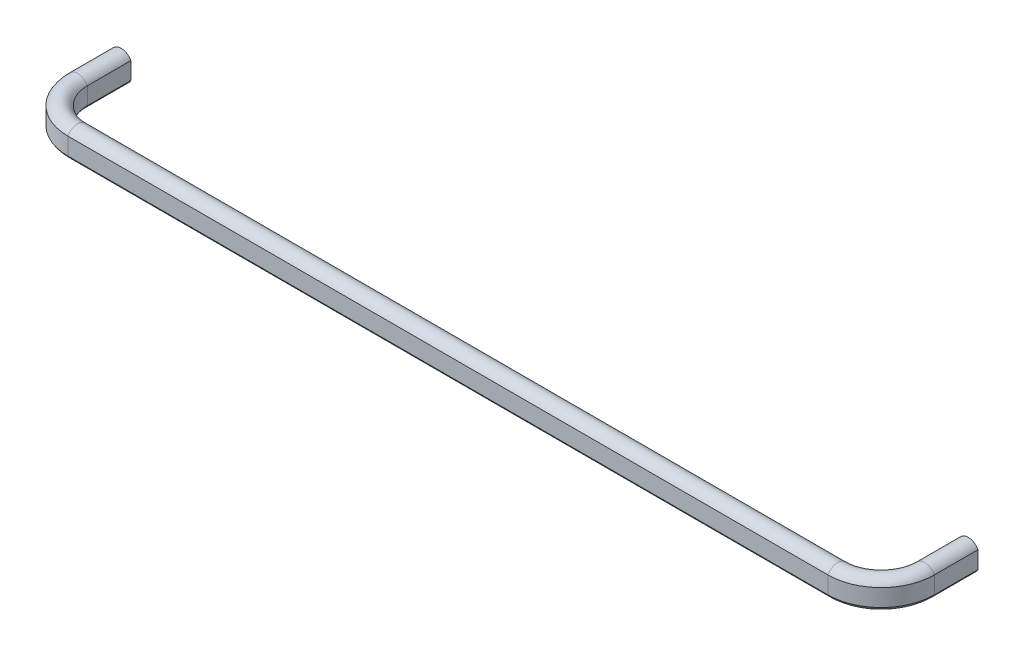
ISO-10303-21;
HEADER;
FILE_DESCRIPTION(('STEP AP214'),'2;1');
FILE_NAME('part.step','',(''),(''),'','','');
FILE_SCHEMA(('AUTOMOTIVE_DESIGN { 1 0 10303 214 1 1 1 1 }'));
ENDSEC;
DATA;
#1=APPLICATION_CONTEXT('core data for automotive mechanical design processes');
#2=APPLICATION_PROTOCOL_DEFINITION('international standard','automotive_design',2000,#1);
#3=PRODUCT_CONTEXT('',#1,'mechanical');
#4=PRODUCT('Part','Part','',(#3));
#5=PRODUCT_RELATED_PRODUCT_CATEGORY('part','',(#4));
#6=PRODUCT_DEFINITION_FORMATION('','',#4);
#7=PRODUCT_DEFINITION_CONTEXT('part definition',#1,'design');
#8=PRODUCT_DEFINITION('design','',#6,#7);
#9=PRODUCT_DEFINITION_SHAPE('','',#8);
#10=(LENGTH_UNIT() NAMED_UNIT(*) SI_UNIT(.MILLI.,.METRE.));
#11=(NAMED_UNIT(*) PLANE_ANGLE_UNIT() SI_UNIT($,.RADIAN.));
#12=(NAMED_UNIT(*) SI_UNIT($,.STERADIAN.) SOLID_ANGLE_UNIT());
#13=UNCERTAINTY_MEASURE_WITH_UNIT(LENGTH_MEASURE(1.E-05),#10,'distance_accuracy_value','');
#14=(GEOMETRIC_REPRESENTATION_CONTEXT(3) GLOBAL_UNCERTAINTY_ASSIGNED_CONTEXT((#13)) GLOBAL_UNIT_ASSIGNED_CONTEXT((#10,
#11,#12)) REPRESENTATION_CONTEXT('',''));
#15=CARTESIAN_POINT('',(0.,0.,0.));
#16=DIRECTION('',(0.,0.,1.));
#17=DIRECTION('',(1.,0.,0.));
#18=AXIS2_PLACEMENT_3D('',#15,#16,#17);
#19=CARTESIAN_POINT('',(2.00072019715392E-07,-1.4999967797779,0.));
#20=DIRECTION('',(0.,0.,1.));
#21=DIRECTION('',(0.,-1.,0.));
#22=AXIS2_PLACEMENT_3D('',#19,#20,#21);
#23=PLANE('',#22);
#24=CARTESIAN_POINT('',(0.,0.,0.));
#25=DIRECTION('',(0.,0.,1.));
#26=DIRECTION('',(1.,0.,0.));
#27=AXIS2_PLACEMENT_3D('',#24,#25,#26);
#28=CIRCLE('',#27,2.94999999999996);
#29=CARTESIAN_POINT('',(2.94999999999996,0.,0.));
#30=VERTEX_POINT('',#29);
#31=EDGE_CURVE('E9',#30,#30,#28,.T.);
#32=ORIENTED_EDGE('',*,*,#31,.T.);
#33=EDGE_LOOP('',(#32));
#34=FACE_BOUND('',#33,.T.);
#35=CARTESIAN_POINT('',(2.00072019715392E-07,-1.4999967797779,0.));
#36=DIRECTION('',(0.,0.,1.));
#37=DIRECTION('',(0.,-1.,0.));
#38=AXIS2_PLACEMENT_3D('',#35,#36,#37);
#39=CIRCLE('',#38,4.50000272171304);
#40=CARTESIAN_POINT('',(-4.,-3.56155079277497,0.));
#41=VERTEX_POINT('',#40);
#42=CARTESIAN_POINT('',(4.00000119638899,-3.56154924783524,0.));
#43=VERTEX_POINT('',#42);
#44=EDGE_CURVE('E209',#41,#43,#39,.T.);
#45=ORIENTED_EDGE('',*,*,#44,.F.);
#46=DIRECTION('',(0.,1.,0.));
#47=VECTOR('',#46,1.);
#48=CARTESIAN_POINT('',(-4.,-3.56155079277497,0.));
#49=LINE('',#48,#47);
#50=CARTESIAN_POINT('',(-4.,3.56155328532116,0.));
#51=VERTEX_POINT('',#50);
#52=EDGE_CURVE('E30',#41,#51,#49,.T.);
#53=ORIENTED_EDGE('',*,*,#52,.T.);
#54=CARTESIAN_POINT('',(2.00072019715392E-07,1.4999992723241,0.));
#55=DIRECTION('',(0.,0.,1.));
#56=DIRECTION('',(0.,-1.,0.));
#57=AXIS2_PLACEMENT_3D('',#54,#55,#56);
#58=CIRCLE('',#57,4.50000072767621);
#59=CARTESIAN_POINT('',(4.00000119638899,3.56155174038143,0.));
#60=VERTEX_POINT('',#59);
#61=EDGE_CURVE('E38',#60,#51,#58,.T.);
#62=ORIENTED_EDGE('',*,*,#61,.F.);
#63=DIRECTION('',(0.,1.,0.));
#64=VECTOR('',#63,1.);
#65=CARTESIAN_POINT('',(4.00000119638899,-3.56154924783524,0.));
#66=LINE('',#65,#64);
#67=EDGE_CURVE('E230',#43,#60,#66,.T.);
#68=ORIENTED_EDGE('',*,*,#67,.F.);
#69=EDGE_LOOP('',(#45,#53,#62,#68));
#70=FACE_BOUND('',#69,.T.);
#71=ADVANCED_FACE('F14',(#34,#70),#23,.F.);
#72=CARTESIAN_POINT('',(349.999999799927,-1.4999967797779,0.));
#73=DIRECTION('',(0.,0.,-1.));
#74=DIRECTION('',(0.,-1.,0.));
#75=AXIS2_PLACEMENT_3D('',#72,#73,#74);
#76=PLANE('',#75);
#77=CARTESIAN_POINT('',(350.,0.,0.));
#78=DIRECTION('',(0.,0.,-1.));
#79=DIRECTION('',(-1.,0.,0.));
#80=AXIS2_PLACEMENT_3D('',#77,#78,#79);
#81=CIRCLE('',#80,2.9499999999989);
#82=CARTESIAN_POINT('',(347.050000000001,0.,0.));
#83=VERTEX_POINT('',#82);
#84=EDGE_CURVE('E236',#83,#83,#81,.F.);
#85=ORIENTED_EDGE('',*,*,#84,.T.);
#86=EDGE_LOOP('',(#85));
#87=FACE_BOUND('',#86,.T.);
#88=CARTESIAN_POINT('',(349.999999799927,-1.4999967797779,0.));
#89=DIRECTION('',(0.,0.,-1.));
#90=DIRECTION('',(0.,-1.,0.));
#91=AXIS2_PLACEMENT_3D('',#88,#89,#90);
#92=CIRCLE('',#91,4.50000272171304);
#93=CARTESIAN_POINT('',(354.,-3.56155079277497,0.));
#94=VERTEX_POINT('',#93);
#95=CARTESIAN_POINT('',(345.99999880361,-3.56154924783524,0.));
#96=VERTEX_POINT('',#95);
#97=EDGE_CURVE('E107',#94,#96,#92,.T.);
#98=ORIENTED_EDGE('',*,*,#97,.T.);
#99=DIRECTION('',(0.,1.,0.));
#100=VECTOR('',#99,1.);
#101=CARTESIAN_POINT('',(345.99999880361,-3.56154924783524,0.));
#102=LINE('',#101,#100);
#103=CARTESIAN_POINT('',(345.99999880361,3.56155174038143,0.));
#104=VERTEX_POINT('',#103);
#105=EDGE_CURVE('E111',#96,#104,#102,.T.);
#106=ORIENTED_EDGE('',*,*,#105,.T.);
#107=CARTESIAN_POINT('',(349.999999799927,1.4999992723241,0.));
#108=DIRECTION('',(0.,0.,-1.));
#109=DIRECTION('',(0.,-1.,0.));
#110=AXIS2_PLACEMENT_3D('',#107,#108,#109);
#111=CIRCLE('',#110,4.50000072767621);
#112=CARTESIAN_POINT('',(354.,3.56155328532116,0.));
#113=VERTEX_POINT('',#112);
#114=EDGE_CURVE('E132',#104,#113,#111,.T.);
#115=ORIENTED_EDGE('',*,*,#114,.T.);
#116=DIRECTION('',(0.,1.,0.));
#117=VECTOR('',#116,1.);
#118=CARTESIAN_POINT('',(354.,-3.56155079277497,0.));
#119=LINE('',#118,#117);
#120=EDGE_CURVE('E114',#94,#113,#119,.T.);
#121=ORIENTED_EDGE('',*,*,#120,.F.);
#122=EDGE_LOOP('',(#98,#106,#115,#121));
#123=FACE_BOUND('',#122,.T.);
#124=ADVANCED_FACE('F109',(#87,#123),#76,.T.);
#125=CARTESIAN_POINT('',(-4.,-3.56155079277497,18.));
#126=DIRECTION('',(-1.,0.,0.));
#127=DIRECTION('',(0.,0.,1.));
#128=AXIS2_PLACEMENT_3D('',#125,#126,#127);
#129=PLANE('',#128);
#130=DIRECTION('',(0.,1.,0.));
#131=VECTOR('',#130,1.);
#132=CARTESIAN_POINT('',(-4.,-3.56155079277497,18.));
#133=LINE('',#132,#131);
#134=CARTESIAN_POINT('',(-4.,-3.56155079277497,18.));
#135=VERTEX_POINT('',#134);
#136=CARTESIAN_POINT('',(-4.,3.56155328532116,18.));
#137=VERTEX_POINT('',#136);
#138=EDGE_CURVE('E200',#135,#137,#133,.T.);
#139=ORIENTED_EDGE('',*,*,#138,.T.);
#140=DIRECTION('',(0.,0.,-1.));
#141=VECTOR('',#140,1.);
#142=CARTESIAN_POINT('',(-4.,3.56155328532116,18.));
#143=LINE('',#142,#141);
#144=EDGE_CURVE('E223',#137,#51,#143,.T.);
#145=ORIENTED_EDGE('',*,*,#144,.T.);
#146=ORIENTED_EDGE('',*,*,#52,.F.);
#147=DIRECTION('',(0.,0.,-1.));
#148=VECTOR('',#147,1.);
#149=CARTESIAN_POINT('',(-4.,-3.56155079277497,18.));
#150=LINE('',#149,#148);
#151=EDGE_CURVE('E225',#135,#41,#150,.T.);
#152=ORIENTED_EDGE('',*,*,#151,.F.);
#153=EDGE_LOOP('',(#139,#145,#146,#152));
#154=FACE_BOUND('',#153,.T.);
#155=ADVANCED_FACE('F262',(#154),#129,.T.);
#156=CARTESIAN_POINT('',(2.00073018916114E-07,1.4999992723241,18.));
#157=DIRECTION('',(0.,0.,-1.));
#158=DIRECTION('',(-1.,0.,0.));
#159=AXIS2_PLACEMENT_3D('',#156,#157,#158);
#160=CYLINDRICAL_SURFACE('',#159,4.50000072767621);
#161=CARTESIAN_POINT('',(2.00073018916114E-07,1.4999992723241,18.));
#162=DIRECTION('',(0.,0.,1.));
#163=DIRECTION('',(0.,-1.,0.));
#164=AXIS2_PLACEMENT_3D('',#161,#162,#163);
#165=CIRCLE('',#164,4.50000072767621);
#166=CARTESIAN_POINT('',(4.00000119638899,3.56155174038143,18.));
#167=VERTEX_POINT('',#166);
#168=EDGE_CURVE('E214',#167,#137,#165,.T.);
#169=ORIENTED_EDGE('',*,*,#168,.F.);
#170=DIRECTION('',(0.,0.,-1.));
#171=VECTOR('',#170,1.);
#172=CARTESIAN_POINT('',(4.00000119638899,3.56155174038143,18.));
#173=LINE('',#172,#171);
#174=EDGE_CURVE('E221',#167,#60,#173,.T.);
#175=ORIENTED_EDGE('',*,*,#174,.T.);
#176=ORIENTED_EDGE('',*,*,#61,.T.);
#177=ORIENTED_EDGE('',*,*,#144,.F.);
#178=EDGE_LOOP('',(#169,#175,#176,#177));
#179=FACE_BOUND('',#178,.T.);
#180=ADVANCED_FACE('F336',(#179),#160,.T.);
#181=CARTESIAN_POINT('',(4.00000119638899,-3.56154924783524,18.));
#182=DIRECTION('',(-1.,0.,0.));
#183=DIRECTION('',(0.,0.,1.));
#184=AXIS2_PLACEMENT_3D('',#181,#182,#183);
#185=PLANE('',#184);
#186=DIRECTION('',(0.,1.,0.));
#187=VECTOR('',#186,1.);
#188=CARTESIAN_POINT('',(4.00000119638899,-3.56154924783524,18.));
#189=LINE('',#188,#187);
#190=CARTESIAN_POINT('',(4.00000119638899,-3.56154924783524,18.));
#191=VERTEX_POINT('',#190);
#192=EDGE_CURVE('E211',#191,#167,#189,.T.);
#193=ORIENTED_EDGE('',*,*,#192,.F.);
#194=DIRECTION('',(0.,0.,-1.));
#195=VECTOR('',#194,1.);
#196=CARTESIAN_POINT('',(4.00000119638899,-3.56154924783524,18.));
#197=LINE('',#196,#195);
#198=EDGE_CURVE('E218',#191,#43,#197,.T.);
#199=ORIENTED_EDGE('',*,*,#198,.T.);
#200=ORIENTED_EDGE('',*,*,#67,.T.);
#201=ORIENTED_EDGE('',*,*,#174,.F.);
#202=EDGE_LOOP('',(#193,#199,#200,#201));
#203=FACE_BOUND('',#202,.T.);
#204=ADVANCED_FACE('F332',(#203),#185,.F.);
#205=CARTESIAN_POINT('',(2.00073018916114E-07,-1.4999967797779,18.));
#206=DIRECTION('',(0.,0.,-1.));
#207=DIRECTION('',(-1.,0.,0.));
#208=AXIS2_PLACEMENT_3D('',#205,#206,#207);
#209=CYLINDRICAL_SURFACE('',#208,4.50000272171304);
#210=CARTESIAN_POINT('',(2.00073018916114E-07,-1.4999967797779,18.));
#211=DIRECTION('',(0.,0.,1.));
#212=DIRECTION('',(0.,-1.,0.));
#213=AXIS2_PLACEMENT_3D('',#210,#211,#212);
#214=CIRCLE('',#213,4.50000272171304);
#215=EDGE_CURVE('E187',#135,#191,#214,.T.);
#216=ORIENTED_EDGE('',*,*,#215,.F.);
#217=ORIENTED_EDGE('',*,*,#151,.T.);
#218=ORIENTED_EDGE('',*,*,#44,.T.);
#219=ORIENTED_EDGE('',*,*,#198,.F.);
#220=EDGE_LOOP('',(#216,#217,#218,#219));
#221=FACE_BOUND('',#220,.T.);
#222=ADVANCED_FACE('F328',(#221),#209,.T.);
#223=CARTESIAN_POINT('',(17.999999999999,6.81897340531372E-13,18.));
#224=DIRECTION('',(0.,-1.,0.));
#225=DIRECTION('',(1.,0.,0.));
#226=AXIS2_PLACEMENT_3D('',#223,#224,#225);
#227=CYLINDRICAL_SURFACE('',#226,21.9999999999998);
#228=DIRECTION('',(0.,1.,0.));
#229=VECTOR('',#228,1.);
#230=CARTESIAN_POINT('',(18.,-3.56155079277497,40.));
#231=LINE('',#230,#229);
#232=CARTESIAN_POINT('',(18.,-3.56155079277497,40.));
#233=VERTEX_POINT('',#232);
#234=CARTESIAN_POINT('',(18.,3.56155328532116,40.));
#235=VERTEX_POINT('',#234);
#236=EDGE_CURVE('E178',#233,#235,#231,.T.);
#237=ORIENTED_EDGE('',*,*,#236,.T.);
#238=CARTESIAN_POINT('',(17.999999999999,3.56155328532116,18.));
#239=DIRECTION('',(0.,-1.,0.));
#240=DIRECTION('',(1.,0.,0.));
#241=AXIS2_PLACEMENT_3D('',#238,#239,#240);
#242=CIRCLE('',#241,21.9999999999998);
#243=EDGE_CURVE('E203',#235,#137,#242,.T.);
#244=ORIENTED_EDGE('',*,*,#243,.T.);
#245=ORIENTED_EDGE('',*,*,#138,.F.);
#246=CARTESIAN_POINT('',(17.999999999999,-3.56155079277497,18.));
#247=DIRECTION('',(0.,-1.,0.));
#248=DIRECTION('',(1.,0.,0.));
#249=AXIS2_PLACEMENT_3D('',#246,#247,#248);
#250=CIRCLE('',#249,21.9999999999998);
#251=EDGE_CURVE('E206',#233,#135,#250,.T.);
#252=ORIENTED_EDGE('',*,*,#251,.F.);
#253=EDGE_LOOP('',(#237,#244,#245,#252));
#254=FACE_BOUND('',#253,.T.);
#255=ADVANCED_FACE('F324',(#254),#227,.T.);
#256=CARTESIAN_POINT('',(17.999999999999,1.4999992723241,18.));
#257=DIRECTION('',(0.,-1.,0.));
#258=DIRECTION('',(1.,0.,0.));
#259=AXIS2_PLACEMENT_3D('',#256,#257,#258);
#260=TOROIDAL_SURFACE('',#259,17.999999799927,4.50000072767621);
#261=CARTESIAN_POINT('',(18.,1.4999992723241,35.999999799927));
#262=DIRECTION('',(1.,0.,0.));
#263=DIRECTION('',(0.,-1.,0.));
#264=AXIS2_PLACEMENT_3D('',#261,#262,#263);
#265=CIRCLE('',#264,4.50000072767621);
#266=CARTESIAN_POINT('',(17.999999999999,3.56155174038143,31.9999988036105));
#267=VERTEX_POINT('',#266);
#268=EDGE_CURVE('E192',#267,#235,#265,.T.);
#269=ORIENTED_EDGE('',*,*,#268,.F.);
#270=CARTESIAN_POINT('',(17.999999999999,3.56155174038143,18.));
#271=DIRECTION('',(0.,-1.,0.));
#272=DIRECTION('',(1.,0.,0.));
#273=AXIS2_PLACEMENT_3D('',#270,#271,#272);
#274=CIRCLE('',#273,13.9999988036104);
#275=EDGE_CURVE('E199',#267,#167,#274,.T.);
#276=ORIENTED_EDGE('',*,*,#275,.T.);
#277=ORIENTED_EDGE('',*,*,#168,.T.);
#278=ORIENTED_EDGE('',*,*,#243,.F.);
#279=EDGE_LOOP('',(#269,#276,#277,#278));
#280=FACE_BOUND('',#279,.T.);
#281=ADVANCED_FACE('F320',(#280),#260,.T.);
#282=CARTESIAN_POINT('',(17.999999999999,6.81897340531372E-13,18.));
#283=DIRECTION('',(0.,-1.,0.));
#284=DIRECTION('',(1.,0.,0.));
#285=AXIS2_PLACEMENT_3D('',#282,#283,#284);
#286=CYLINDRICAL_SURFACE('',#285,13.9999988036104);
#287=DIRECTION('',(0.,1.,0.));
#288=VECTOR('',#287,1.);
#289=CARTESIAN_POINT('',(17.999999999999,-3.56154924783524,31.9999988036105));
#290=LINE('',#289,#288);
#291=CARTESIAN_POINT('',(17.999999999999,-3.56154924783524,31.9999988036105));
#292=VERTEX_POINT('',#291);
#293=EDGE_CURVE('E189',#292,#267,#290,.T.);
#294=ORIENTED_EDGE('',*,*,#293,.F.);
#295=CARTESIAN_POINT('',(17.999999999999,-3.56154924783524,18.));
#296=DIRECTION('',(0.,-1.,0.));
#297=DIRECTION('',(1.,0.,0.));
#298=AXIS2_PLACEMENT_3D('',#295,#296,#297);
#299=CIRCLE('',#298,13.9999988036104);
#300=EDGE_CURVE('E196',#292,#191,#299,.T.);
#301=ORIENTED_EDGE('',*,*,#300,.T.);
#302=ORIENTED_EDGE('',*,*,#192,.T.);
#303=ORIENTED_EDGE('',*,*,#275,.F.);
#304=EDGE_LOOP('',(#294,#301,#302,#303));
#305=FACE_BOUND('',#304,.T.);
#306=ADVANCED_FACE('F316',(#305),#286,.F.);
#307=CARTESIAN_POINT('',(17.999999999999,-1.4999967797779,18.));
#308=DIRECTION('',(0.,-1.,0.));
#309=DIRECTION('',(1.,0.,0.));
#310=AXIS2_PLACEMENT_3D('',#307,#308,#309);
#311=TOROIDAL_SURFACE('',#310,17.999999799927,4.50000272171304);
#312=CARTESIAN_POINT('',(18.,-1.4999967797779,35.999999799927));
#313=DIRECTION('',(1.,0.,0.));
#314=DIRECTION('',(0.,-1.,0.));
#315=AXIS2_PLACEMENT_3D('',#312,#313,#314);
#316=CIRCLE('',#315,4.50000272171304);
#317=EDGE_CURVE('E165',#233,#292,#316,.T.);
#318=ORIENTED_EDGE('',*,*,#317,.F.);
#319=ORIENTED_EDGE('',*,*,#251,.T.);
#320=ORIENTED_EDGE('',*,*,#215,.T.);
#321=ORIENTED_EDGE('',*,*,#300,.F.);
#322=EDGE_LOOP('',(#318,#319,#320,#321));
#323=FACE_BOUND('',#322,.T.);
#324=ADVANCED_FACE('F312',(#323),#311,.T.);
#325=CARTESIAN_POINT('',(332.,-3.56155079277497,40.));
#326=DIRECTION('',(0.,0.,1.));
#327=DIRECTION('',(0.,1.,0.));
#328=AXIS2_PLACEMENT_3D('',#325,#326,#327);
#329=PLANE('',#328);
#330=DIRECTION('',(0.,1.,0.));
#331=VECTOR('',#330,1.);
#332=CARTESIAN_POINT('',(332.,-3.56155079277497,40.));
#333=LINE('',#332,#331);
#334=CARTESIAN_POINT('',(332.,-3.56155079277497,40.));
#335=VERTEX_POINT('',#334);
#336=CARTESIAN_POINT('',(332.,3.56155328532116,40.));
#337=VERTEX_POINT('',#336);
#338=EDGE_CURVE('E156',#335,#337,#333,.T.);
#339=ORIENTED_EDGE('',*,*,#338,.T.);
#340=DIRECTION('',(-1.,0.,0.));
#341=VECTOR('',#340,1.);
#342=CARTESIAN_POINT('',(332.,3.56155328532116,40.));
#343=LINE('',#342,#341);
#344=EDGE_CURVE('E181',#337,#235,#343,.T.);
#345=ORIENTED_EDGE('',*,*,#344,.T.);
#346=ORIENTED_EDGE('',*,*,#236,.F.);
#347=DIRECTION('',(-1.,0.,0.));
#348=VECTOR('',#347,1.);
#349=CARTESIAN_POINT('',(332.,-3.56155079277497,40.));
#350=LINE('',#349,#348);
#351=EDGE_CURVE('E184',#335,#233,#350,.T.);
#352=ORIENTED_EDGE('',*,*,#351,.F.);
#353=EDGE_LOOP('',(#339,#345,#346,#352));
#354=FACE_BOUND('',#353,.T.);
#355=ADVANCED_FACE('F308',(#354),#329,.T.);
#356=CARTESIAN_POINT('',(332.,1.4999992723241,35.999999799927));
#357=DIRECTION('',(-1.,0.,0.));
#358=DIRECTION('',(0.,0.,1.));
#359=AXIS2_PLACEMENT_3D('',#356,#357,#358);
#360=CYLINDRICAL_SURFACE('',#359,4.50000072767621);
#361=CARTESIAN_POINT('',(332.,1.4999992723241,35.999999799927));
#362=DIRECTION('',(1.,0.,0.));
#363=DIRECTION('',(0.,-1.,0.));
#364=AXIS2_PLACEMENT_3D('',#361,#362,#363);
#365=CIRCLE('',#364,4.50000072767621);
#366=CARTESIAN_POINT('',(332.,3.56155174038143,31.9999988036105));
#367=VERTEX_POINT('',#366);
#368=EDGE_CURVE('E170',#367,#337,#365,.T.);
#369=ORIENTED_EDGE('',*,*,#368,.F.);
#370=DIRECTION('',(-1.,0.,0.));
#371=VECTOR('',#370,1.);
#372=CARTESIAN_POINT('',(332.,3.56155174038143,31.9999988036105));
#373=LINE('',#372,#371);
#374=EDGE_CURVE('E177',#367,#267,#373,.T.);
#375=ORIENTED_EDGE('',*,*,#374,.T.);
#376=ORIENTED_EDGE('',*,*,#268,.T.);
#377=ORIENTED_EDGE('',*,*,#344,.F.);
#378=EDGE_LOOP('',(#369,#375,#376,#377));
#379=FACE_BOUND('',#378,.T.);
#380=ADVANCED_FACE('F304',(#379),#360,.T.);
#381=CARTESIAN_POINT('',(332.,-3.56154924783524,31.9999988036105));
#382=DIRECTION('',(0.,0.,1.));
#383=DIRECTION('',(1.,0.,0.));
#384=AXIS2_PLACEMENT_3D('',#381,#382,#383);
#385=PLANE('',#384);
#386=DIRECTION('',(0.,1.,0.));
#387=VECTOR('',#386,1.);
#388=CARTESIAN_POINT('',(332.,-3.56154924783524,31.9999988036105));
#389=LINE('',#388,#387);
#390=CARTESIAN_POINT('',(332.,-3.56154924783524,31.9999988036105));
#391=VERTEX_POINT('',#390);
#392=EDGE_CURVE('E167',#391,#367,#389,.T.);
#393=ORIENTED_EDGE('',*,*,#392,.F.);
#394=DIRECTION('',(-1.,0.,0.));
#395=VECTOR('',#394,1.);
#396=CARTESIAN_POINT('',(332.,-3.56154924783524,31.9999988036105));
#397=LINE('',#396,#395);
#398=EDGE_CURVE('E174',#391,#292,#397,.T.);
#399=ORIENTED_EDGE('',*,*,#398,.T.);
#400=ORIENTED_EDGE('',*,*,#293,.T.);
#401=ORIENTED_EDGE('',*,*,#374,.F.);
#402=EDGE_LOOP('',(#393,#399,#400,#401));
#403=FACE_BOUND('',#402,.T.);
#404=ADVANCED_FACE('F300',(#403),#385,.F.);
#405=CARTESIAN_POINT('',(332.,-1.4999967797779,35.999999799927));
#406=DIRECTION('',(-1.,0.,0.));
#407=DIRECTION('',(0.,0.,1.));
#408=AXIS2_PLACEMENT_3D('',#405,#406,#407);
#409=CYLINDRICAL_SURFACE('',#408,4.50000272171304);
#410=CARTESIAN_POINT('',(332.,-1.4999967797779,35.999999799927));
#411=DIRECTION('',(1.,0.,0.));
#412=DIRECTION('',(0.,-1.,0.));
#413=AXIS2_PLACEMENT_3D('',#410,#411,#412);
#414=CIRCLE('',#413,4.50000272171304);
#415=EDGE_CURVE('E151',#335,#391,#414,.T.);
#416=ORIENTED_EDGE('',*,*,#415,.F.);
#417=ORIENTED_EDGE('',*,*,#351,.T.);
#418=ORIENTED_EDGE('',*,*,#317,.T.);
#419=ORIENTED_EDGE('',*,*,#398,.F.);
#420=EDGE_LOOP('',(#416,#417,#418,#419));
#421=FACE_BOUND('',#420,.T.);
#422=ADVANCED_FACE('F296',(#421),#409,.T.);
#423=CARTESIAN_POINT('',(332.,6.81897340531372E-13,18.));
#424=DIRECTION('',(0.,-1.,0.));
#425=DIRECTION('',(1.,0.,0.));
#426=AXIS2_PLACEMENT_3D('',#423,#424,#425);
#427=CYLINDRICAL_SURFACE('',#426,21.9999999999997);
#428=DIRECTION('',(0.,1.,0.));
#429=VECTOR('',#428,1.);
#430=CARTESIAN_POINT('',(354.,-3.56155079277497,18.));
#431=LINE('',#430,#429);
#432=CARTESIAN_POINT('',(354.,-3.56155079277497,18.));
#433=VERTEX_POINT('',#432);
#434=CARTESIAN_POINT('',(354.,3.56155328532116,18.));
#435=VERTEX_POINT('',#434);
#436=EDGE_CURVE('E128',#433,#435,#431,.T.);
#437=ORIENTED_EDGE('',*,*,#436,.T.);
#438=CARTESIAN_POINT('',(332.,3.56155328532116,18.));
#439=DIRECTION('',(0.,-1.,0.));
#440=DIRECTION('',(1.,0.,0.));
#441=AXIS2_PLACEMENT_3D('',#438,#439,#440);
#442=CIRCLE('',#441,21.9999999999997);
#443=EDGE_CURVE('E159',#435,#337,#442,.T.);
#444=ORIENTED_EDGE('',*,*,#443,.T.);
#445=ORIENTED_EDGE('',*,*,#338,.F.);
#446=CARTESIAN_POINT('',(332.,-3.56155079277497,18.));
#447=DIRECTION('',(0.,-1.,0.));
#448=DIRECTION('',(1.,0.,0.));
#449=AXIS2_PLACEMENT_3D('',#446,#447,#448);
#450=CIRCLE('',#449,21.9999999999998);
#451=EDGE_CURVE('E162',#433,#335,#450,.T.);
#452=ORIENTED_EDGE('',*,*,#451,.F.);
#453=EDGE_LOOP('',(#437,#444,#445,#452));
#454=FACE_BOUND('',#453,.T.);
#455=ADVANCED_FACE('F292',(#454),#427,.T.);
#456=CARTESIAN_POINT('',(332.,1.4999992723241,18.));
#457=DIRECTION('',(0.,-1.,0.));
#458=DIRECTION('',(1.,0.,0.));
#459=AXIS2_PLACEMENT_3D('',#456,#457,#458);
#460=TOROIDAL_SURFACE('',#459,17.999999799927,4.50000072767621);
#461=CARTESIAN_POINT('',(349.999999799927,1.4999992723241,18.));
#462=DIRECTION('',(0.,0.,-1.));
#463=DIRECTION('',(0.,-1.,0.));
#464=AXIS2_PLACEMENT_3D('',#461,#462,#463);
#465=CIRCLE('',#464,4.50000072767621);
#466=CARTESIAN_POINT('',(345.99999880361,3.56155174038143,18.));
#467=VERTEX_POINT('',#466);
#468=EDGE_CURVE('E141',#467,#435,#465,.T.);
#469=ORIENTED_EDGE('',*,*,#468,.F.);
#470=CARTESIAN_POINT('',(332.,3.56155174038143,18.));
#471=DIRECTION('',(0.,-1.,0.));
#472=DIRECTION('',(1.,0.,0.));
#473=AXIS2_PLACEMENT_3D('',#470,#471,#472);
#474=CIRCLE('',#473,13.9999988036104);
#475=EDGE_CURVE('E155',#467,#367,#474,.T.);
#476=ORIENTED_EDGE('',*,*,#475,.T.);
#477=ORIENTED_EDGE('',*,*,#368,.T.);
#478=ORIENTED_EDGE('',*,*,#443,.F.);
#479=EDGE_LOOP('',(#469,#476,#477,#478));
#480=FACE_BOUND('',#479,.T.);
#481=ADVANCED_FACE('F288',(#480),#460,.T.);
#482=CARTESIAN_POINT('',(332.,6.81897340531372E-13,18.));
#483=DIRECTION('',(0.,-1.,0.));
#484=DIRECTION('',(1.,0.,0.));
#485=AXIS2_PLACEMENT_3D('',#482,#483,#484);
#486=CYLINDRICAL_SURFACE('',#485,13.9999988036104);
#487=DIRECTION('',(0.,1.,0.));
#488=VECTOR('',#487,1.);
#489=CARTESIAN_POINT('',(345.99999880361,-3.56154924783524,18.));
#490=LINE('',#489,#488);
#491=CARTESIAN_POINT('',(345.99999880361,-3.56154924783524,18.));
#492=VERTEX_POINT('',#491);
#493=EDGE_CURVE('E139',#492,#467,#490,.T.);
#494=ORIENTED_EDGE('',*,*,#493,.F.);
#495=CARTESIAN_POINT('',(332.,-3.56154924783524,18.));
#496=DIRECTION('',(0.,-1.,0.));
#497=DIRECTION('',(1.,0.,0.));
#498=AXIS2_PLACEMENT_3D('',#495,#496,#497);
#499=CIRCLE('',#498,13.9999988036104);
#500=EDGE_CURVE('E152',#492,#391,#499,.T.);
#501=ORIENTED_EDGE('',*,*,#500,.T.);
#502=ORIENTED_EDGE('',*,*,#392,.T.);
#503=ORIENTED_EDGE('',*,*,#475,.F.);
#504=EDGE_LOOP('',(#494,#501,#502,#503));
#505=FACE_BOUND('',#504,.T.);
#506=ADVANCED_FACE('F284',(#505),#486,.F.);
#507=CARTESIAN_POINT('',(332.,-1.4999967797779,18.));
#508=DIRECTION('',(0.,-1.,0.));
#509=DIRECTION('',(1.,0.,0.));
#510=AXIS2_PLACEMENT_3D('',#507,#508,#509);
#511=TOROIDAL_SURFACE('',#510,17.999999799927,4.50000272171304);
#512=CARTESIAN_POINT('',(349.999999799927,-1.4999967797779,18.));
#513=DIRECTION('',(0.,0.,-1.));
#514=DIRECTION('',(0.,-1.,0.));
#515=AXIS2_PLACEMENT_3D('',#512,#513,#514);
#516=CIRCLE('',#515,4.50000272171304);
#517=EDGE_CURVE('E123',#433,#492,#516,.T.);
#518=ORIENTED_EDGE('',*,*,#517,.F.);
#519=ORIENTED_EDGE('',*,*,#451,.T.);
#520=ORIENTED_EDGE('',*,*,#415,.T.);
#521=ORIENTED_EDGE('',*,*,#500,.F.);
#522=EDGE_LOOP('',(#518,#519,#520,#521));
#523=FACE_BOUND('',#522,.T.);
#524=ADVANCED_FACE('F280',(#523),#511,.T.);
#525=CARTESIAN_POINT('',(354.,-3.56155079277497,18.));
#526=DIRECTION('',(-1.,0.,0.));
#527=DIRECTION('',(0.,-1.,0.));
#528=AXIS2_PLACEMENT_3D('',#525,#526,#527);
#529=PLANE('',#528);
#530=DIRECTION('',(0.,0.,-1.));
#531=VECTOR('',#530,1.);
#532=CARTESIAN_POINT('',(354.,3.56155328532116,18.));
#533=LINE('',#532,#531);
#534=EDGE_CURVE('E146',#435,#113,#533,.T.);
#535=ORIENTED_EDGE('',*,*,#534,.F.);
#536=ORIENTED_EDGE('',*,*,#436,.F.);
#537=DIRECTION('',(0.,0.,-1.));
#538=VECTOR('',#537,1.);
#539=CARTESIAN_POINT('',(354.,-3.56155079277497,18.));
#540=LINE('',#539,#538);
#541=EDGE_CURVE('E149',#433,#94,#540,.T.);
#542=ORIENTED_EDGE('',*,*,#541,.T.);
#543=ORIENTED_EDGE('',*,*,#120,.T.);
#544=EDGE_LOOP('',(#535,#536,#542,#543));
#545=FACE_BOUND('',#544,.T.);
#546=ADVANCED_FACE('F276',(#545),#529,.F.);
#547=CARTESIAN_POINT('',(349.999999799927,1.4999992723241,18.));
#548=DIRECTION('',(0.,0.,-1.));
#549=DIRECTION('',(-1.,0.,0.));
#550=AXIS2_PLACEMENT_3D('',#547,#548,#549);
#551=CYLINDRICAL_SURFACE('',#550,4.50000072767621);
#552=DIRECTION('',(0.,0.,-1.));
#553=VECTOR('',#552,1.);
#554=CARTESIAN_POINT('',(345.99999880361,3.56155174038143,18.));
#555=LINE('',#554,#553);
#556=EDGE_CURVE('E127',#467,#104,#555,.T.);
#557=ORIENTED_EDGE('',*,*,#556,.F.);
#558=ORIENTED_EDGE('',*,*,#468,.T.);
#559=ORIENTED_EDGE('',*,*,#534,.T.);
#560=ORIENTED_EDGE('',*,*,#114,.F.);
#561=EDGE_LOOP('',(#557,#558,#559,#560));
#562=FACE_BOUND('',#561,.T.);
#563=ADVANCED_FACE('F273',(#562),#551,.T.);
#564=CARTESIAN_POINT('',(345.99999880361,-3.56154924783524,18.));
#565=DIRECTION('',(-1.,0.,0.));
#566=DIRECTION('',(0.,0.,1.));
#567=AXIS2_PLACEMENT_3D('',#564,#565,#566);
#568=PLANE('',#567);
#569=DIRECTION('',(0.,0.,-1.));
#570=VECTOR('',#569,1.);
#571=CARTESIAN_POINT('',(345.99999880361,-3.56154924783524,18.));
#572=LINE('',#571,#570);
#573=EDGE_CURVE('E120',#492,#96,#572,.T.);
#574=ORIENTED_EDGE('',*,*,#573,.F.);
#575=ORIENTED_EDGE('',*,*,#493,.T.);
#576=ORIENTED_EDGE('',*,*,#556,.T.);
#577=ORIENTED_EDGE('',*,*,#105,.F.);
#578=EDGE_LOOP('',(#574,#575,#576,#577));
#579=FACE_BOUND('',#578,.T.);
#580=ADVANCED_FACE('F130',(#579),#568,.T.);
#581=CARTESIAN_POINT('',(349.999999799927,-1.4999967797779,18.));
#582=DIRECTION('',(0.,0.,-1.));
#583=DIRECTION('',(-1.,0.,0.));
#584=AXIS2_PLACEMENT_3D('',#581,#582,#583);
#585=CYLINDRICAL_SURFACE('',#584,4.50000272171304);
#586=ORIENTED_EDGE('',*,*,#517,.T.);
#587=ORIENTED_EDGE('',*,*,#573,.T.);
#588=ORIENTED_EDGE('',*,*,#97,.F.);
#589=ORIENTED_EDGE('',*,*,#541,.F.);
#590=EDGE_LOOP('',(#586,#587,#588,#589));
#591=FACE_BOUND('',#590,.T.);
#592=ADVANCED_FACE('F121',(#591),#585,.T.);
#593=CARTESIAN_POINT('',(350.,0.,9.99999999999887));
#594=DIRECTION('',(0.,0.,-1.));
#595=DIRECTION('',(-1.,0.,0.));
#596=AXIS2_PLACEMENT_3D('',#593,#594,#595);
#597=CYLINDRICAL_SURFACE('',#596,2.5);
#598=CARTESIAN_POINT('',(350.,0.,0.449999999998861));
#599=DIRECTION('',(0.,0.,-1.));
#600=DIRECTION('',(-1.,0.,0.));
#601=AXIS2_PLACEMENT_3D('',#598,#599,#600);
#602=CIRCLE('',#601,2.5);
#603=CARTESIAN_POINT('',(347.5,0.,0.449999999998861));
#604=VERTEX_POINT('',#603);
#605=EDGE_CURVE('E228',#604,#604,#602,.T.);
#606=ORIENTED_EDGE('',*,*,#605,.T.);
#607=EDGE_LOOP('',(#606));
#608=FACE_BOUND('',#607,.T.);
#609=CARTESIAN_POINT('',(350.,0.,9.99999999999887));
#610=DIRECTION('',(0.,0.,-1.));
#611=DIRECTION('',(-1.,0.,0.));
#612=AXIS2_PLACEMENT_3D('',#609,#610,#611);
#613=CIRCLE('',#612,2.5);
#614=CARTESIAN_POINT('',(347.5,0.,9.99999999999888));
#615=VERTEX_POINT('',#614);
#616=EDGE_CURVE('E554',#615,#615,#613,.T.);
#617=ORIENTED_EDGE('',*,*,#616,.F.);
#618=EDGE_LOOP('',(#617));
#619=FACE_BOUND('',#618,.T.);
#620=ADVANCED_FACE('F270',(#608,#619),#597,.F.);
#621=CARTESIAN_POINT('',(350.,0.,9.99999999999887));
#622=DIRECTION('',(0.,0.,-1.));
#623=DIRECTION('',(-1.,0.,0.));
#624=AXIS2_PLACEMENT_3D('',#621,#622,#623);
#625=PLANE('',#624);
#626=ORIENTED_EDGE('',*,*,#616,.T.);
#627=EDGE_LOOP('',(#626));
#628=FACE_BOUND('',#627,.T.);
#629=ADVANCED_FACE('F483',(#628),#625,.T.);
#630=CARTESIAN_POINT('',(0.,0.,10.));
#631=DIRECTION('',(0.,0.,-1.));
#632=DIRECTION('',(-1.,0.,0.));
#633=AXIS2_PLACEMENT_3D('',#630,#631,#632);
#634=CYLINDRICAL_SURFACE('',#633,2.5);
#635=CARTESIAN_POINT('',(0.,0.,0.449999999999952));
#636=DIRECTION('',(0.,0.,1.));
#637=DIRECTION('',(1.,0.,0.));
#638=AXIS2_PLACEMENT_3D('',#635,#636,#637);
#639=CIRCLE('',#638,2.5);
#640=CARTESIAN_POINT('',(2.5,0.,0.449999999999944));
#641=VERTEX_POINT('',#640);
#642=EDGE_CURVE('E23',#641,#641,#639,.F.);
#643=ORIENTED_EDGE('',*,*,#642,.T.);
#644=EDGE_LOOP('',(#643));
#645=FACE_BOUND('',#644,.T.);
#646=CARTESIAN_POINT('',(0.,0.,10.));
#647=DIRECTION('',(0.,0.,-1.));
#648=DIRECTION('',(-1.,0.,0.));
#649=AXIS2_PLACEMENT_3D('',#646,#647,#648);
#650=CIRCLE('',#649,2.5);
#651=CARTESIAN_POINT('',(-2.49999999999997,0.,10.));
#652=VERTEX_POINT('',#651);
#653=EDGE_CURVE('E117',#652,#652,#650,.T.);
#654=ORIENTED_EDGE('',*,*,#653,.F.);
#655=EDGE_LOOP('',(#654));
#656=FACE_BOUND('',#655,.T.);
#657=ADVANCED_FACE('F241',(#645,#656),#634,.F.);
#658=CARTESIAN_POINT('',(0.,0.,10.));
#659=DIRECTION('',(0.,0.,-1.));
#660=DIRECTION('',(-1.,0.,0.));
#661=AXIS2_PLACEMENT_3D('',#658,#659,#660);
#662=PLANE('',#661);
#663=ORIENTED_EDGE('',*,*,#653,.T.);
#664=EDGE_LOOP('',(#663));
#665=FACE_BOUND('',#664,.T.);
#666=ADVANCED_FACE('F252',(#665),#662,.T.);
#667=CARTESIAN_POINT('',(350.,0.,0.449999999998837));
#668=DIRECTION('',(0.,0.,-1.));
#669=DIRECTION('',(-1.,0.,0.));
#670=AXIS2_PLACEMENT_3D('',#667,#668,#669);
#671=CONICAL_SURFACE('',#670,2.5,0.785398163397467);
#672=ORIENTED_EDGE('',*,*,#84,.F.);
#673=EDGE_LOOP('',(#672));
#674=FACE_BOUND('',#673,.T.);
#675=ORIENTED_EDGE('',*,*,#605,.F.);
#676=EDGE_LOOP('',(#675));
#677=FACE_BOUND('',#676,.T.);
#678=ADVANCED_FACE('F245',(#674,#677),#671,.F.);
#679=CARTESIAN_POINT('',(0.,0.,0.449999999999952));
#680=DIRECTION('',(0.,0.,-1.));
#681=DIRECTION('',(-1.,0.,0.));
#682=AXIS2_PLACEMENT_3D('',#679,#680,#681);
#683=CONICAL_SURFACE('',#682,2.5,0.78539816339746);
#684=ORIENTED_EDGE('',*,*,#31,.F.);
#685=EDGE_LOOP('',(#684));
#686=FACE_BOUND('',#685,.T.);
#687=ORIENTED_EDGE('',*,*,#642,.F.);
#688=EDGE_LOOP('',(#687));
#689=FACE_BOUND('',#688,.T.);
#690=ADVANCED_FACE('F17',(#686,#689),#683,.F.);
#691=CLOSED_SHELL('',(#71,#124,#155,#180,#204,#222,#255,#281,#306,#324,#355,#380,#404,#422,#455,
#481,#506,#524,#546,#563,#580,#592,#620,#629,#657,#666,#678,#690));
#692=MANIFOLD_SOLID_BREP('B1',#691);
#693=ADVANCED_BREP_SHAPE_REPRESENTATION('',(#18,#692),#14);
#694=SHAPE_DEFINITION_REPRESENTATION(#9,#693);
ENDSEC;
END-ISO-10303-21;
